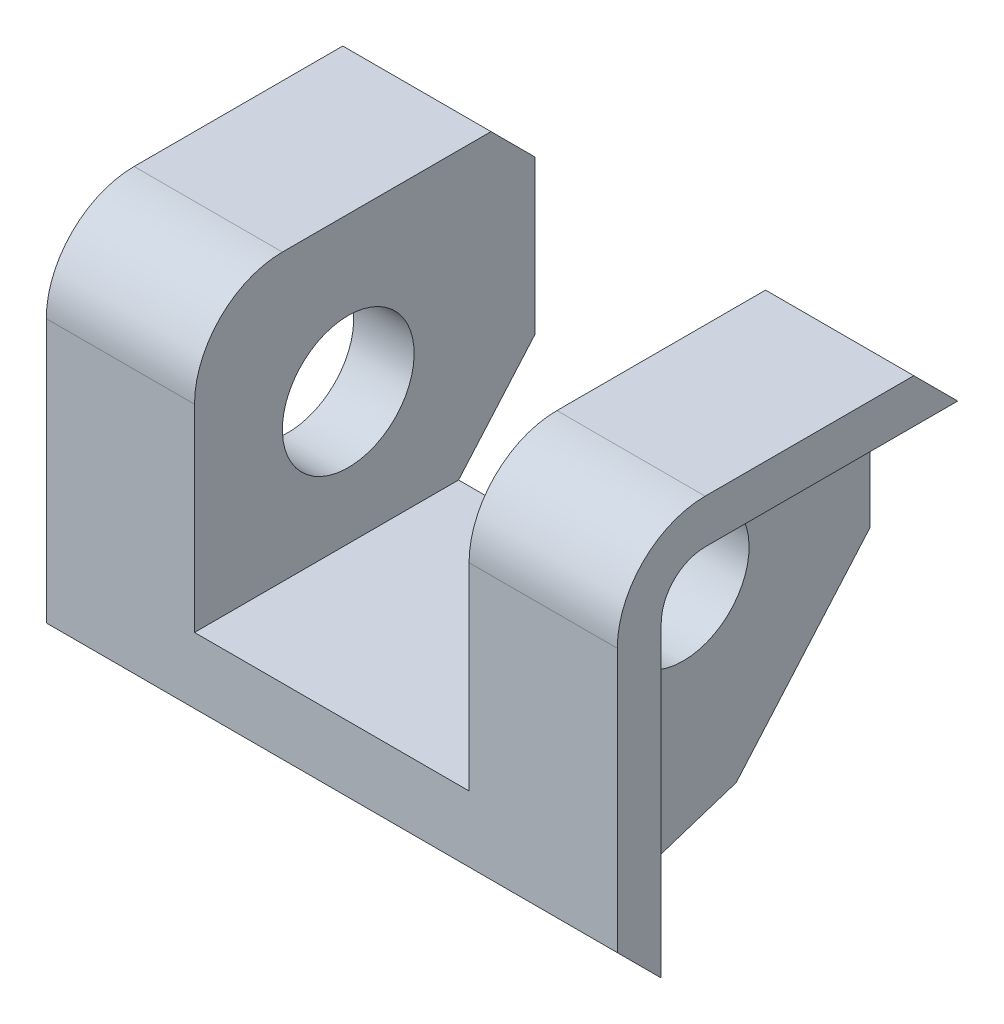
ISO-10303-21;
HEADER;
FILE_DESCRIPTION(('STEP AP214'),'2;1');
FILE_NAME('part.step','',(''),(''),'','','');
FILE_SCHEMA(('AUTOMOTIVE_DESIGN { 1 0 10303 214 1 1 1 1 }'));
ENDSEC;
DATA;
#1=APPLICATION_CONTEXT('core data for automotive mechanical design processes');
#2=APPLICATION_PROTOCOL_DEFINITION('international standard','automotive_design',2000,#1);
#3=PRODUCT_CONTEXT('',#1,'mechanical');
#4=PRODUCT('Part','Part','',(#3));
#5=PRODUCT_RELATED_PRODUCT_CATEGORY('part','',(#4));
#6=PRODUCT_DEFINITION_FORMATION('','',#4);
#7=PRODUCT_DEFINITION_CONTEXT('part definition',#1,'design');
#8=PRODUCT_DEFINITION('design','',#6,#7);
#9=PRODUCT_DEFINITION_SHAPE('','',#8);
#10=(LENGTH_UNIT() NAMED_UNIT(*) SI_UNIT(.MILLI.,.METRE.));
#11=(NAMED_UNIT(*) PLANE_ANGLE_UNIT() SI_UNIT($,.RADIAN.));
#12=(NAMED_UNIT(*) SI_UNIT($,.STERADIAN.) SOLID_ANGLE_UNIT());
#13=UNCERTAINTY_MEASURE_WITH_UNIT(LENGTH_MEASURE(1.E-05),#10,'distance_accuracy_value','');
#14=(GEOMETRIC_REPRESENTATION_CONTEXT(3) GLOBAL_UNCERTAINTY_ASSIGNED_CONTEXT((#13)) GLOBAL_UNIT_ASSIGNED_CONTEXT((#10,
#11,#12)) REPRESENTATION_CONTEXT('',''));
#15=CARTESIAN_POINT('',(0.,0.,0.));
#16=DIRECTION('',(0.,0.,1.));
#17=DIRECTION('',(1.,0.,0.));
#18=AXIS2_PLACEMENT_3D('',#15,#16,#17);
#19=CARTESIAN_POINT('',(-13.,-2.,-8.5));
#20=DIRECTION('',(0.,0.,-1.));
#21=DIRECTION('',(-1.,0.,0.));
#22=AXIS2_PLACEMENT_3D('',#19,#20,#21);
#23=PLANE('',#22);
#24=DIRECTION('',(0.,1.,0.));
#25=VECTOR('',#24,1.);
#26=CARTESIAN_POINT('',(6.25,-6.,-8.5));
#27=LINE('',#26,#25);
#28=CARTESIAN_POINT('',(6.25,-2.,-8.5));
#29=VERTEX_POINT('',#28);
#30=CARTESIAN_POINT('',(6.25,5.,-8.5));
#31=VERTEX_POINT('',#30);
#32=EDGE_CURVE('E199',#29,#31,#27,.T.);
#33=ORIENTED_EDGE('',*,*,#32,.T.);
#34=DIRECTION('',(1.,0.,0.));
#35=VECTOR('',#34,1.);
#36=CARTESIAN_POINT('',(-13.,5.,-8.5));
#37=LINE('',#36,#35);
#38=CARTESIAN_POINT('',(9.,5.,-8.5));
#39=VERTEX_POINT('',#38);
#40=EDGE_CURVE('E37',#31,#39,#37,.T.);
#41=ORIENTED_EDGE('',*,*,#40,.T.);
#42=DIRECTION('',(0.,1.,0.));
#43=VECTOR('',#42,1.);
#44=CARTESIAN_POINT('',(9.,-2.,-8.5));
#45=LINE('',#44,#43);
#46=CARTESIAN_POINT('',(9.,-2.,-8.5));
#47=VERTEX_POINT('',#46);
#48=EDGE_CURVE('E241',#47,#39,#45,.T.);
#49=ORIENTED_EDGE('',*,*,#48,.F.);
#50=DIRECTION('',(1.,0.,0.));
#51=VECTOR('',#50,1.);
#52=CARTESIAN_POINT('',(-13.,-2.,-8.5));
#53=LINE('',#52,#51);
#54=EDGE_CURVE('E329',#29,#47,#53,.T.);
#55=ORIENTED_EDGE('',*,*,#54,.F.);
#56=EDGE_LOOP('',(#33,#41,#49,#55));
#57=FACE_BOUND('',#56,.T.);
#58=ADVANCED_FACE('F14',(#57),#23,.T.);
#59=CARTESIAN_POINT('',(-13.,0.,0.));
#60=DIRECTION('',(1.,0.,0.));
#61=DIRECTION('',(0.,-1.,0.));
#62=AXIS2_PLACEMENT_3D('',#59,#60,#61);
#63=CYLINDRICAL_SURFACE('',#62,3.);
#64=CARTESIAN_POINT('',(6.25,0.,0.));
#65=DIRECTION('',(1.,0.,0.));
#66=DIRECTION('',(0.,-1.,0.));
#67=AXIS2_PLACEMENT_3D('',#64,#65,#66);
#68=CIRCLE('',#67,3.);
#69=CARTESIAN_POINT('',(6.25,-3.,0.));
#70=VERTEX_POINT('',#69);
#71=EDGE_CURVE('E215',#70,#70,#68,.T.);
#72=ORIENTED_EDGE('',*,*,#71,.F.);
#73=EDGE_LOOP('',(#72));
#74=FACE_BOUND('',#73,.T.);
#75=CARTESIAN_POINT('',(9.,0.,0.));
#76=DIRECTION('',(1.,0.,0.));
#77=DIRECTION('',(0.,-1.,0.));
#78=AXIS2_PLACEMENT_3D('',#75,#76,#77);
#79=CIRCLE('',#78,3.);
#80=CARTESIAN_POINT('',(9.,-3.,0.));
#81=VERTEX_POINT('',#80);
#82=EDGE_CURVE('E250',#81,#81,#79,.T.);
#83=ORIENTED_EDGE('',*,*,#82,.T.);
#84=EDGE_LOOP('',(#83));
#85=FACE_BOUND('',#84,.T.);
#86=ADVANCED_FACE('F455',(#74,#85),#63,.F.);
#87=CARTESIAN_POINT('',(-13.,3.,3.));
#88=DIRECTION('',(1.,0.,0.));
#89=DIRECTION('',(0.,-1.,0.));
#90=AXIS2_PLACEMENT_3D('',#87,#88,#89);
#91=CYLINDRICAL_SURFACE('',#90,4.);
#92=CARTESIAN_POINT('',(6.25,3.,3.));
#93=DIRECTION('',(1.,0.,0.));
#94=DIRECTION('',(0.,-1.,0.));
#95=AXIS2_PLACEMENT_3D('',#92,#93,#94);
#96=CIRCLE('',#95,4.);
#97=CARTESIAN_POINT('',(6.25,3.,7.));
#98=VERTEX_POINT('',#97);
#99=CARTESIAN_POINT('',(6.25,7.,3.));
#100=VERTEX_POINT('',#99);
#101=EDGE_CURVE('E213',#98,#100,#96,.F.);
#102=ORIENTED_EDGE('',*,*,#101,.F.);
#103=DIRECTION('',(1.,0.,0.));
#104=VECTOR('',#103,1.);
#105=CARTESIAN_POINT('',(-13.,3.,7.));
#106=LINE('',#105,#104);
#107=CARTESIAN_POINT('',(13.,3.,7.));
#108=VERTEX_POINT('',#107);
#109=EDGE_CURVE('E195',#98,#108,#106,.T.);
#110=ORIENTED_EDGE('',*,*,#109,.T.);
#111=CARTESIAN_POINT('',(13.,3.,3.));
#112=DIRECTION('',(1.,0.,0.));
#113=DIRECTION('',(0.,-1.,0.));
#114=AXIS2_PLACEMENT_3D('',#111,#112,#113);
#115=CIRCLE('',#114,4.);
#116=CARTESIAN_POINT('',(13.,7.,3.));
#117=VERTEX_POINT('',#116);
#118=EDGE_CURVE('E292',#117,#108,#115,.T.);
#119=ORIENTED_EDGE('',*,*,#118,.F.);
#120=DIRECTION('',(1.,0.,0.));
#121=VECTOR('',#120,1.);
#122=CARTESIAN_POINT('',(-13.,7.,3.));
#123=LINE('',#122,#121);
#124=EDGE_CURVE('E308',#100,#117,#123,.T.);
#125=ORIENTED_EDGE('',*,*,#124,.F.);
#126=EDGE_LOOP('',(#102,#110,#119,#125));
#127=FACE_BOUND('',#126,.T.);
#128=ADVANCED_FACE('F408',(#127),#91,.T.);
#129=CARTESIAN_POINT('',(-13.,7.,-8.5));
#130=DIRECTION('',(0.,1.,0.));
#131=DIRECTION('',(0.,0.,-1.));
#132=AXIS2_PLACEMENT_3D('',#129,#130,#131);
#133=PLANE('',#132);
#134=DIRECTION('',(0.,0.,-1.));
#135=VECTOR('',#134,1.);
#136=CARTESIAN_POINT('',(6.25,7.,-8.5));
#137=LINE('',#136,#135);
#138=CARTESIAN_POINT('',(6.25,7.,-6.5));
#139=VERTEX_POINT('',#138);
#140=EDGE_CURVE('E211',#100,#139,#137,.T.);
#141=ORIENTED_EDGE('',*,*,#140,.F.);
#142=ORIENTED_EDGE('',*,*,#124,.T.);
#143=DIRECTION('',(0.,0.,1.));
#144=VECTOR('',#143,1.);
#145=CARTESIAN_POINT('',(13.,7.,-8.5));
#146=LINE('',#145,#144);
#147=CARTESIAN_POINT('',(13.,7.,-6.5));
#148=VERTEX_POINT('',#147);
#149=EDGE_CURVE('E289',#148,#117,#146,.T.);
#150=ORIENTED_EDGE('',*,*,#149,.F.);
#151=DIRECTION('',(-1.,0.,0.));
#152=VECTOR('',#151,1.);
#153=CARTESIAN_POINT('',(-13.,7.,-6.5));
#154=LINE('',#153,#152);
#155=EDGE_CURVE('E350',#148,#139,#154,.T.);
#156=ORIENTED_EDGE('',*,*,#155,.T.);
#157=EDGE_LOOP('',(#141,#142,#150,#156));
#158=FACE_BOUND('',#157,.T.);
#159=ADVANCED_FACE('F404',(#158),#133,.T.);
#160=CARTESIAN_POINT('',(-13.,5.,-8.5));
#161=DIRECTION('',(0.,-0.707106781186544,0.707106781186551));
#162=DIRECTION('',(0.,0.707106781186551,0.707106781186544));
#163=AXIS2_PLACEMENT_3D('',#160,#161,#162);
#164=PLANE('',#163);
#165=DIRECTION('',(0.,0.707106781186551,0.707106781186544));
#166=VECTOR('',#165,1.);
#167=CARTESIAN_POINT('',(6.25,5.,-8.5));
#168=LINE('',#167,#166);
#169=EDGE_CURVE('E9',#139,#31,#168,.F.);
#170=ORIENTED_EDGE('',*,*,#169,.F.);
#171=ORIENTED_EDGE('',*,*,#155,.F.);
#172=DIRECTION('',(0.,-0.707106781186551,-0.707106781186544));
#173=VECTOR('',#172,1.);
#174=CARTESIAN_POINT('',(13.,9.75,-3.75000000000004));
#175=LINE('',#174,#173);
#176=CARTESIAN_POINT('',(13.,5.,-8.5));
#177=VERTEX_POINT('',#176);
#178=EDGE_CURVE('E336',#177,#148,#175,.F.);
#179=ORIENTED_EDGE('',*,*,#178,.F.);
#180=DIRECTION('',(1.,0.,0.));
#181=VECTOR('',#180,1.);
#182=CARTESIAN_POINT('',(9.,5.,-8.5));
#183=LINE('',#182,#181);
#184=EDGE_CURVE('E243',#39,#177,#183,.T.);
#185=ORIENTED_EDGE('',*,*,#184,.F.);
#186=ORIENTED_EDGE('',*,*,#40,.F.);
#187=EDGE_LOOP('',(#170,#171,#179,#185,#186));
#188=FACE_BOUND('',#187,.T.);
#189=ADVANCED_FACE('F401',(#188),#164,.F.);
#190=DIRECTION('',(0.,-1.,0.));
#191=VECTOR('',#190,1.);
#192=CARTESIAN_POINT('',(-6.25,20.,-8.5));
#193=LINE('',#192,#191);
#194=CARTESIAN_POINT('',(-6.25,5.,-8.5));
#195=VERTEX_POINT('',#194);
#196=CARTESIAN_POINT('',(-6.25,-2.,-8.5));
#197=VERTEX_POINT('',#196);
#198=EDGE_CURVE('E29',#195,#197,#193,.T.);
#199=ORIENTED_EDGE('',*,*,#198,.T.);
#200=CARTESIAN_POINT('',(-9.,-2.,-8.5));
#201=VERTEX_POINT('',#200);
#202=EDGE_CURVE('E330',#201,#197,#53,.T.);
#203=ORIENTED_EDGE('',*,*,#202,.F.);
#204=DIRECTION('',(0.,1.,0.));
#205=VECTOR('',#204,1.);
#206=CARTESIAN_POINT('',(-9.,-2.,-8.5));
#207=LINE('',#206,#205);
#208=CARTESIAN_POINT('',(-9.,5.,-8.5));
#209=VERTEX_POINT('',#208);
#210=EDGE_CURVE('E266',#201,#209,#207,.T.);
#211=ORIENTED_EDGE('',*,*,#210,.T.);
#212=EDGE_CURVE('E349',#209,#195,#37,.T.);
#213=ORIENTED_EDGE('',*,*,#212,.T.);
#214=EDGE_LOOP('',(#199,#203,#211,#213));
#215=FACE_BOUND('',#214,.T.);
#216=ADVANCED_FACE('F411',(#215),#23,.T.);
#217=CARTESIAN_POINT('',(-13.,-9.,-2.41499283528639));
#218=DIRECTION('',(0.,-0.656059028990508,-0.754709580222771));
#219=DIRECTION('',(0.,-0.754709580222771,0.656059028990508));
#220=AXIS2_PLACEMENT_3D('',#217,#218,#219);
#221=PLANE('',#220);
#222=DIRECTION('',(0.,-0.754709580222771,0.656059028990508));
#223=VECTOR('',#222,1.);
#224=CARTESIAN_POINT('',(6.25,-9.,-2.41499283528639));
#225=LINE('',#224,#223);
#226=CARTESIAN_POINT('',(6.25,-6.,-5.02285304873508));
#227=VERTEX_POINT('',#226);
#228=EDGE_CURVE('E177',#29,#227,#225,.T.);
#229=ORIENTED_EDGE('',*,*,#228,.F.);
#230=ORIENTED_EDGE('',*,*,#54,.T.);
#231=DIRECTION('',(0.,0.754709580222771,-0.656059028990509));
#232=VECTOR('',#231,1.);
#233=CARTESIAN_POINT('',(9.,-9.,-2.41499283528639));
#234=LINE('',#233,#232);
#235=CARTESIAN_POINT('',(9.,-9.,-2.41499283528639));
#236=VERTEX_POINT('',#235);
#237=EDGE_CURVE('E227',#236,#47,#234,.T.);
#238=ORIENTED_EDGE('',*,*,#237,.F.);
#239=DIRECTION('',(1.,0.,0.));
#240=VECTOR('',#239,1.);
#241=CARTESIAN_POINT('',(-13.,-9.,-2.41499283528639));
#242=LINE('',#241,#240);
#243=CARTESIAN_POINT('',(-9.,-9.,-2.41499283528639));
#244=VERTEX_POINT('',#243);
#245=EDGE_CURVE('E326',#244,#236,#242,.T.);
#246=ORIENTED_EDGE('',*,*,#245,.F.);
#247=DIRECTION('',(0.,0.754709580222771,-0.656059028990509));
#248=VECTOR('',#247,1.);
#249=CARTESIAN_POINT('',(-9.,-9.,-2.41499283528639));
#250=LINE('',#249,#248);
#251=EDGE_CURVE('E263',#244,#201,#250,.T.);
#252=ORIENTED_EDGE('',*,*,#251,.T.);
#253=ORIENTED_EDGE('',*,*,#202,.T.);
#254=DIRECTION('',(0.,0.754709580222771,-0.656059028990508));
#255=VECTOR('',#254,1.);
#256=CARTESIAN_POINT('',(-6.25,-9.,-2.41499283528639));
#257=LINE('',#256,#255);
#258=CARTESIAN_POINT('',(-6.25,-6.,-5.02285304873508));
#259=VERTEX_POINT('',#258);
#260=EDGE_CURVE('E209',#259,#197,#257,.T.);
#261=ORIENTED_EDGE('',*,*,#260,.F.);
#262=DIRECTION('',(1.,0.,0.));
#263=VECTOR('',#262,1.);
#264=CARTESIAN_POINT('',(-13.,-6.,-5.02285304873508));
#265=LINE('',#264,#263);
#266=EDGE_CURVE('E219',#259,#227,#265,.T.);
#267=ORIENTED_EDGE('',*,*,#266,.T.);
#268=EDGE_LOOP('',(#229,#230,#238,#246,#252,#253,#261,#267));
#269=FACE_BOUND('',#268,.T.);
#270=ADVANCED_FACE('F16',(#269),#221,.T.);
#271=CARTESIAN_POINT('',(-13.,-9.,-2.41499283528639));
#272=DIRECTION('',(0.,0.951056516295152,0.309016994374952));
#273=DIRECTION('',(0.,0.309016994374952,-0.951056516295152));
#274=AXIS2_PLACEMENT_3D('',#271,#272,#273);
#275=PLANE('',#274);
#276=DIRECTION('',(0.,-0.309016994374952,0.951056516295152));
#277=VECTOR('',#276,1.);
#278=CARTESIAN_POINT('',(9.,-9.,-2.41499283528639));
#279=LINE('',#278,#277);
#280=CARTESIAN_POINT('',(9.,-10.7594378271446,3.));
#281=VERTEX_POINT('',#280);
#282=EDGE_CURVE('E230',#236,#281,#279,.T.);
#283=ORIENTED_EDGE('',*,*,#282,.T.);
#284=DIRECTION('',(1.,0.,0.));
#285=VECTOR('',#284,1.);
#286=CARTESIAN_POINT('',(-13.,-10.7594378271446,3.));
#287=LINE('',#286,#285);
#288=CARTESIAN_POINT('',(-9.,-10.7594378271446,3.));
#289=VERTEX_POINT('',#288);
#290=EDGE_CURVE('E323',#289,#281,#287,.T.);
#291=ORIENTED_EDGE('',*,*,#290,.F.);
#292=DIRECTION('',(0.,-0.309016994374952,0.951056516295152));
#293=VECTOR('',#292,1.);
#294=CARTESIAN_POINT('',(-9.,-9.,-2.41499283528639));
#295=LINE('',#294,#293);
#296=EDGE_CURVE('E277',#244,#289,#295,.T.);
#297=ORIENTED_EDGE('',*,*,#296,.F.);
#298=ORIENTED_EDGE('',*,*,#245,.T.);
#299=EDGE_LOOP('',(#283,#291,#297,#298));
#300=FACE_BOUND('',#299,.T.);
#301=ADVANCED_FACE('F422',(#300),#275,.F.);
#302=CARTESIAN_POINT('',(-13.,-10.7594378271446,3.));
#303=DIRECTION('',(0.,0.,-1.));
#304=DIRECTION('',(-1.,0.,0.));
#305=AXIS2_PLACEMENT_3D('',#302,#303,#304);
#306=PLANE('',#305);
#307=DIRECTION('',(0.,-1.,0.));
#308=VECTOR('',#307,1.);
#309=CARTESIAN_POINT('',(9.,-10.7594378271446,3.));
#310=LINE('',#309,#308);
#311=CARTESIAN_POINT('',(9.,-7.5,3.));
#312=VERTEX_POINT('',#311);
#313=EDGE_CURVE('E255',#312,#281,#310,.T.);
#314=ORIENTED_EDGE('',*,*,#313,.F.);
#315=DIRECTION('',(1.,0.,0.));
#316=VECTOR('',#315,1.);
#317=CARTESIAN_POINT('',(-13.,-7.5,3.));
#318=LINE('',#317,#316);
#319=CARTESIAN_POINT('',(-9.,-7.5,3.));
#320=VERTEX_POINT('',#319);
#321=EDGE_CURVE('E320',#320,#312,#318,.T.);
#322=ORIENTED_EDGE('',*,*,#321,.F.);
#323=DIRECTION('',(0.,1.,0.));
#324=VECTOR('',#323,1.);
#325=CARTESIAN_POINT('',(-9.,-10.7594378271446,3.));
#326=LINE('',#325,#324);
#327=EDGE_CURVE('E287',#289,#320,#326,.T.);
#328=ORIENTED_EDGE('',*,*,#327,.F.);
#329=ORIENTED_EDGE('',*,*,#290,.T.);
#330=EDGE_LOOP('',(#314,#322,#328,#329));
#331=FACE_BOUND('',#330,.T.);
#332=ADVANCED_FACE('F429',(#331),#306,.F.);
#333=CARTESIAN_POINT('',(-13.,-7.5,3.));
#334=DIRECTION('',(0.,1.,0.));
#335=DIRECTION('',(1.,0.,0.));
#336=AXIS2_PLACEMENT_3D('',#333,#334,#335);
#337=PLANE('',#336);
#338=DIRECTION('',(0.,0.,-1.));
#339=VECTOR('',#338,1.);
#340=CARTESIAN_POINT('',(9.,-7.5,3.));
#341=LINE('',#340,#339);
#342=CARTESIAN_POINT('',(9.,-7.5,5.));
#343=VERTEX_POINT('',#342);
#344=EDGE_CURVE('E253',#343,#312,#341,.T.);
#345=ORIENTED_EDGE('',*,*,#344,.F.);
#346=DIRECTION('',(1.,0.,0.));
#347=VECTOR('',#346,1.);
#348=CARTESIAN_POINT('',(-13.,-7.5,5.));
#349=LINE('',#348,#347);
#350=CARTESIAN_POINT('',(-9.,-7.5,5.));
#351=VERTEX_POINT('',#350);
#352=EDGE_CURVE('E317',#351,#343,#349,.T.);
#353=ORIENTED_EDGE('',*,*,#352,.F.);
#354=DIRECTION('',(0.,0.,1.));
#355=VECTOR('',#354,1.);
#356=CARTESIAN_POINT('',(-9.,-7.5,3.));
#357=LINE('',#356,#355);
#358=EDGE_CURVE('E285',#320,#351,#357,.T.);
#359=ORIENTED_EDGE('',*,*,#358,.F.);
#360=ORIENTED_EDGE('',*,*,#321,.T.);
#361=EDGE_LOOP('',(#345,#353,#359,#360));
#362=FACE_BOUND('',#361,.T.);
#363=ADVANCED_FACE('F432',(#362),#337,.F.);
#364=CARTESIAN_POINT('',(-6.25,0.,0.));
#365=DIRECTION('',(-1.,0.,0.));
#366=DIRECTION('',(0.,1.,0.));
#367=AXIS2_PLACEMENT_3D('',#364,#365,#366);
#368=CIRCLE('',#367,3.);
#369=CARTESIAN_POINT('',(-6.25,3.,0.));
#370=VERTEX_POINT('',#369);
#371=EDGE_CURVE('E206',#370,#370,#368,.T.);
#372=ORIENTED_EDGE('',*,*,#371,.F.);
#373=EDGE_LOOP('',(#372));
#374=FACE_BOUND('',#373,.T.);
#375=CARTESIAN_POINT('',(-9.,0.,0.));
#376=DIRECTION('',(-1.,0.,0.));
#377=DIRECTION('',(0.,1.,0.));
#378=AXIS2_PLACEMENT_3D('',#375,#376,#377);
#379=CIRCLE('',#378,3.);
#380=CARTESIAN_POINT('',(-9.,3.,0.));
#381=VERTEX_POINT('',#380);
#382=EDGE_CURVE('E284',#381,#381,#379,.T.);
#383=ORIENTED_EDGE('',*,*,#382,.T.);
#384=EDGE_LOOP('',(#383));
#385=FACE_BOUND('',#384,.T.);
#386=ADVANCED_FACE('F463',(#374,#385),#63,.F.);
#387=CARTESIAN_POINT('',(13.,3.,3.));
#388=DIRECTION('',(1.,0.,0.));
#389=DIRECTION('',(0.,-1.,0.));
#390=AXIS2_PLACEMENT_3D('',#387,#388,#389);
#391=PLANE('',#390);
#392=DIRECTION('',(0.,1.,0.));
#393=VECTOR('',#392,1.);
#394=CARTESIAN_POINT('',(13.,-11.,5.));
#395=LINE('',#394,#393);
#396=CARTESIAN_POINT('',(13.,-11.,5.));
#397=VERTEX_POINT('',#396);
#398=CARTESIAN_POINT('',(13.,3.,5.));
#399=VERTEX_POINT('',#398);
#400=EDGE_CURVE('E297',#397,#399,#395,.T.);
#401=ORIENTED_EDGE('',*,*,#400,.T.);
#402=CARTESIAN_POINT('',(13.,3.,3.));
#403=DIRECTION('',(-1.,0.,0.));
#404=DIRECTION('',(0.,1.,0.));
#405=AXIS2_PLACEMENT_3D('',#402,#403,#404);
#406=CIRCLE('',#405,2.);
#407=CARTESIAN_POINT('',(13.,5.,3.));
#408=VERTEX_POINT('',#407);
#409=EDGE_CURVE('E221',#399,#408,#406,.T.);
#410=ORIENTED_EDGE('',*,*,#409,.T.);
#411=DIRECTION('',(0.,0.,1.));
#412=VECTOR('',#411,1.);
#413=CARTESIAN_POINT('',(13.,5.,-8.5));
#414=LINE('',#413,#412);
#415=EDGE_CURVE('E224',#177,#408,#414,.T.);
#416=ORIENTED_EDGE('',*,*,#415,.F.);
#417=ORIENTED_EDGE('',*,*,#178,.T.);
#418=ORIENTED_EDGE('',*,*,#149,.T.);
#419=ORIENTED_EDGE('',*,*,#118,.T.);
#420=DIRECTION('',(0.,1.,0.));
#421=VECTOR('',#420,1.);
#422=CARTESIAN_POINT('',(13.,-11.,7.));
#423=LINE('',#422,#421);
#424=CARTESIAN_POINT('',(13.,-9.,7.));
#425=VERTEX_POINT('',#424);
#426=EDGE_CURVE('E295',#425,#108,#423,.T.);
#427=ORIENTED_EDGE('',*,*,#426,.F.);
#428=DIRECTION('',(0.,0.707106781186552,0.707106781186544));
#429=VECTOR('',#428,1.);
#430=CARTESIAN_POINT('',(13.,-4.99999999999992,11.));
#431=LINE('',#430,#429);
#432=EDGE_CURVE('E338',#425,#397,#431,.F.);
#433=ORIENTED_EDGE('',*,*,#432,.T.);
#434=EDGE_LOOP('',(#401,#410,#416,#417,#418,#419,#427,#433));
#435=FACE_BOUND('',#434,.T.);
#436=ADVANCED_FACE('F384',(#435),#391,.T.);
#437=CARTESIAN_POINT('',(-13.,3.,3.));
#438=DIRECTION('',(1.,0.,0.));
#439=DIRECTION('',(0.,-1.,0.));
#440=AXIS2_PLACEMENT_3D('',#437,#438,#439);
#441=PLANE('',#440);
#442=DIRECTION('',(0.,0.,1.));
#443=VECTOR('',#442,1.);
#444=CARTESIAN_POINT('',(-13.,5.,-8.5));
#445=LINE('',#444,#443);
#446=CARTESIAN_POINT('',(-13.,5.,-8.5));
#447=VERTEX_POINT('',#446);
#448=CARTESIAN_POINT('',(-13.,5.,3.));
#449=VERTEX_POINT('',#448);
#450=EDGE_CURVE('E257',#447,#449,#445,.T.);
#451=ORIENTED_EDGE('',*,*,#450,.T.);
#452=CARTESIAN_POINT('',(-13.,3.,3.));
#453=DIRECTION('',(-1.,0.,0.));
#454=DIRECTION('',(0.,1.,0.));
#455=AXIS2_PLACEMENT_3D('',#452,#453,#454);
#456=CIRCLE('',#455,2.);
#457=CARTESIAN_POINT('',(-13.,3.,5.));
#458=VERTEX_POINT('',#457);
#459=EDGE_CURVE('E260',#458,#449,#456,.T.);
#460=ORIENTED_EDGE('',*,*,#459,.F.);
#461=DIRECTION('',(0.,1.,0.));
#462=VECTOR('',#461,1.);
#463=CARTESIAN_POINT('',(-13.,-11.,5.));
#464=LINE('',#463,#462);
#465=CARTESIAN_POINT('',(-13.,-11.,5.));
#466=VERTEX_POINT('',#465);
#467=EDGE_CURVE('E306',#466,#458,#464,.T.);
#468=ORIENTED_EDGE('',*,*,#467,.F.);
#469=DIRECTION('',(0.,-0.707106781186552,-0.707106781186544));
#470=VECTOR('',#469,1.);
#471=CARTESIAN_POINT('',(-13.,-9.,7.));
#472=LINE('',#471,#470);
#473=CARTESIAN_POINT('',(-13.,-9.,7.));
#474=VERTEX_POINT('',#473);
#475=EDGE_CURVE('E344',#466,#474,#472,.F.);
#476=ORIENTED_EDGE('',*,*,#475,.T.);
#477=DIRECTION('',(0.,1.,0.));
#478=VECTOR('',#477,1.);
#479=CARTESIAN_POINT('',(-13.,-11.,7.));
#480=LINE('',#479,#478);
#481=CARTESIAN_POINT('',(-13.,3.,7.));
#482=VERTEX_POINT('',#481);
#483=EDGE_CURVE('E304',#474,#482,#480,.T.);
#484=ORIENTED_EDGE('',*,*,#483,.T.);
#485=CARTESIAN_POINT('',(-13.,3.,3.));
#486=DIRECTION('',(1.,0.,0.));
#487=DIRECTION('',(0.,-1.,0.));
#488=AXIS2_PLACEMENT_3D('',#485,#486,#487);
#489=CIRCLE('',#488,4.);
#490=CARTESIAN_POINT('',(-13.,7.,3.));
#491=VERTEX_POINT('',#490);
#492=EDGE_CURVE('E301',#491,#482,#489,.T.);
#493=ORIENTED_EDGE('',*,*,#492,.F.);
#494=DIRECTION('',(0.,0.,1.));
#495=VECTOR('',#494,1.);
#496=CARTESIAN_POINT('',(-13.,7.,-8.5));
#497=LINE('',#496,#495);
#498=CARTESIAN_POINT('',(-13.,7.,-6.5));
#499=VERTEX_POINT('',#498);
#500=EDGE_CURVE('E299',#499,#491,#497,.T.);
#501=ORIENTED_EDGE('',*,*,#500,.F.);
#502=DIRECTION('',(0.,0.707106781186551,0.707106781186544));
#503=VECTOR('',#502,1.);
#504=CARTESIAN_POINT('',(-13.,5.,-8.5));
#505=LINE('',#504,#503);
#506=EDGE_CURVE('E341',#499,#447,#505,.F.);
#507=ORIENTED_EDGE('',*,*,#506,.T.);
#508=EDGE_LOOP('',(#451,#460,#468,#476,#484,#493,#501,#507));
#509=FACE_BOUND('',#508,.T.);
#510=ADVANCED_FACE('F370',(#509),#441,.F.);
#511=CARTESIAN_POINT('',(-13.,-11.,5.));
#512=DIRECTION('',(0.,0.,-1.));
#513=DIRECTION('',(-1.,0.,0.));
#514=AXIS2_PLACEMENT_3D('',#511,#512,#513);
#515=PLANE('',#514);
#516=ORIENTED_EDGE('',*,*,#400,.F.);
#517=DIRECTION('',(1.,0.,0.));
#518=VECTOR('',#517,1.);
#519=CARTESIAN_POINT('',(-13.,-11.,5.));
#520=LINE('',#519,#518);
#521=EDGE_CURVE('E315',#466,#397,#520,.T.);
#522=ORIENTED_EDGE('',*,*,#521,.F.);
#523=ORIENTED_EDGE('',*,*,#467,.T.);
#524=DIRECTION('',(-1.,0.,0.));
#525=VECTOR('',#524,1.);
#526=CARTESIAN_POINT('',(-9.,3.,5.));
#527=LINE('',#526,#525);
#528=CARTESIAN_POINT('',(-9.,3.,5.));
#529=VERTEX_POINT('',#528);
#530=EDGE_CURVE('E279',#529,#458,#527,.T.);
#531=ORIENTED_EDGE('',*,*,#530,.F.);
#532=DIRECTION('',(0.,1.,0.));
#533=VECTOR('',#532,1.);
#534=CARTESIAN_POINT('',(-9.,-11.4092772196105,5.));
#535=LINE('',#534,#533);
#536=EDGE_CURVE('E275',#351,#529,#535,.T.);
#537=ORIENTED_EDGE('',*,*,#536,.F.);
#538=ORIENTED_EDGE('',*,*,#352,.T.);
#539=DIRECTION('',(0.,1.,0.));
#540=VECTOR('',#539,1.);
#541=CARTESIAN_POINT('',(9.,-11.4092772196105,5.));
#542=LINE('',#541,#540);
#543=CARTESIAN_POINT('',(9.,3.,5.));
#544=VERTEX_POINT('',#543);
#545=EDGE_CURVE('E233',#343,#544,#542,.T.);
#546=ORIENTED_EDGE('',*,*,#545,.T.);
#547=DIRECTION('',(1.,0.,0.));
#548=VECTOR('',#547,1.);
#549=CARTESIAN_POINT('',(9.,3.,5.));
#550=LINE('',#549,#548);
#551=EDGE_CURVE('E247',#544,#399,#550,.T.);
#552=ORIENTED_EDGE('',*,*,#551,.T.);
#553=EDGE_LOOP('',(#516,#522,#523,#531,#537,#538,#546,#552));
#554=FACE_BOUND('',#553,.T.);
#555=ADVANCED_FACE('F386',(#554),#515,.T.);
#556=CARTESIAN_POINT('',(-13.,-11.,7.));
#557=DIRECTION('',(0.,0.,-1.));
#558=DIRECTION('',(0.,-1.,0.));
#559=AXIS2_PLACEMENT_3D('',#556,#557,#558);
#560=PLANE('',#559);
#561=ORIENTED_EDGE('',*,*,#109,.F.);
#562=DIRECTION('',(0.,1.,0.));
#563=VECTOR('',#562,1.);
#564=CARTESIAN_POINT('',(6.25,-6.,7.));
#565=LINE('',#564,#563);
#566=CARTESIAN_POINT('',(6.25,-6.,7.));
#567=VERTEX_POINT('',#566);
#568=EDGE_CURVE('E174',#567,#98,#565,.T.);
#569=ORIENTED_EDGE('',*,*,#568,.F.);
#570=DIRECTION('',(-1.,0.,0.));
#571=VECTOR('',#570,1.);
#572=CARTESIAN_POINT('',(6.25,-6.,7.));
#573=LINE('',#572,#571);
#574=CARTESIAN_POINT('',(-6.25,-6.,7.));
#575=VERTEX_POINT('',#574);
#576=EDGE_CURVE('E185',#567,#575,#573,.T.);
#577=ORIENTED_EDGE('',*,*,#576,.T.);
#578=DIRECTION('',(0.,-1.,0.));
#579=VECTOR('',#578,1.);
#580=CARTESIAN_POINT('',(-6.25,20.,7.));
#581=LINE('',#580,#579);
#582=CARTESIAN_POINT('',(-6.25,3.,7.));
#583=VERTEX_POINT('',#582);
#584=EDGE_CURVE('E190',#583,#575,#581,.T.);
#585=ORIENTED_EDGE('',*,*,#584,.F.);
#586=EDGE_CURVE('E312',#482,#583,#106,.T.);
#587=ORIENTED_EDGE('',*,*,#586,.F.);
#588=ORIENTED_EDGE('',*,*,#483,.F.);
#589=DIRECTION('',(1.,0.,0.));
#590=VECTOR('',#589,1.);
#591=CARTESIAN_POINT('',(-13.,-9.,7.));
#592=LINE('',#591,#590);
#593=EDGE_CURVE('E333',#474,#425,#592,.T.);
#594=ORIENTED_EDGE('',*,*,#593,.T.);
#595=ORIENTED_EDGE('',*,*,#426,.T.);
#596=EDGE_LOOP('',(#561,#569,#577,#585,#587,#588,#594,#595));
#597=FACE_BOUND('',#596,.T.);
#598=ADVANCED_FACE('F193',(#597),#560,.F.);
#599=CARTESIAN_POINT('',(-6.25,3.,3.));
#600=DIRECTION('',(-1.,0.,0.));
#601=DIRECTION('',(0.,1.,0.));
#602=AXIS2_PLACEMENT_3D('',#599,#600,#601);
#603=CIRCLE('',#602,4.);
#604=CARTESIAN_POINT('',(-6.25,7.,3.));
#605=VERTEX_POINT('',#604);
#606=EDGE_CURVE('E204',#605,#583,#603,.F.);
#607=ORIENTED_EDGE('',*,*,#606,.F.);
#608=EDGE_CURVE('E309',#491,#605,#123,.T.);
#609=ORIENTED_EDGE('',*,*,#608,.F.);
#610=ORIENTED_EDGE('',*,*,#492,.T.);
#611=ORIENTED_EDGE('',*,*,#586,.T.);
#612=EDGE_LOOP('',(#607,#609,#610,#611));
#613=FACE_BOUND('',#612,.T.);
#614=ADVANCED_FACE('F374',(#613),#91,.T.);
#615=DIRECTION('',(0.,0.,1.));
#616=VECTOR('',#615,1.);
#617=CARTESIAN_POINT('',(-6.25,7.,-8.5));
#618=LINE('',#617,#616);
#619=CARTESIAN_POINT('',(-6.25,7.,-6.5));
#620=VERTEX_POINT('',#619);
#621=EDGE_CURVE('E180',#620,#605,#618,.T.);
#622=ORIENTED_EDGE('',*,*,#621,.F.);
#623=EDGE_CURVE('E348',#620,#499,#154,.T.);
#624=ORIENTED_EDGE('',*,*,#623,.T.);
#625=ORIENTED_EDGE('',*,*,#500,.T.);
#626=ORIENTED_EDGE('',*,*,#608,.T.);
#627=EDGE_LOOP('',(#622,#624,#625,#626));
#628=FACE_BOUND('',#627,.T.);
#629=ADVANCED_FACE('F363',(#628),#133,.T.);
#630=CARTESIAN_POINT('',(-13.,-9.,7.));
#631=DIRECTION('',(0.,0.707106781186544,-0.707106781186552));
#632=DIRECTION('',(0.,-0.707106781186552,-0.707106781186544));
#633=AXIS2_PLACEMENT_3D('',#630,#631,#632);
#634=PLANE('',#633);
#635=ORIENTED_EDGE('',*,*,#475,.F.);
#636=ORIENTED_EDGE('',*,*,#521,.T.);
#637=ORIENTED_EDGE('',*,*,#432,.F.);
#638=ORIENTED_EDGE('',*,*,#593,.F.);
#639=EDGE_LOOP('',(#635,#636,#637,#638));
#640=FACE_BOUND('',#639,.T.);
#641=ADVANCED_FACE('F381',(#640),#634,.F.);
#642=DIRECTION('',(0.,-0.707106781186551,-0.707106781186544));
#643=VECTOR('',#642,1.);
#644=CARTESIAN_POINT('',(-6.25,5.,-8.5));
#645=LINE('',#644,#643);
#646=EDGE_CURVE('E22',#195,#620,#645,.F.);
#647=ORIENTED_EDGE('',*,*,#646,.F.);
#648=ORIENTED_EDGE('',*,*,#212,.F.);
#649=EDGE_CURVE('E346',#447,#209,#37,.T.);
#650=ORIENTED_EDGE('',*,*,#649,.F.);
#651=ORIENTED_EDGE('',*,*,#506,.F.);
#652=ORIENTED_EDGE('',*,*,#623,.F.);
#653=EDGE_LOOP('',(#647,#648,#650,#651,#652));
#654=FACE_BOUND('',#653,.T.);
#655=ADVANCED_FACE('F367',(#654),#164,.F.);
#656=CARTESIAN_POINT('',(-9.,3.,3.));
#657=DIRECTION('',(-1.,0.,0.));
#658=DIRECTION('',(0.,1.,0.));
#659=AXIS2_PLACEMENT_3D('',#656,#657,#658);
#660=PLANE('',#659);
#661=ORIENTED_EDGE('',*,*,#382,.F.);
#662=EDGE_LOOP('',(#661));
#663=FACE_BOUND('',#662,.T.);
#664=ORIENTED_EDGE('',*,*,#327,.T.);
#665=ORIENTED_EDGE('',*,*,#358,.T.);
#666=ORIENTED_EDGE('',*,*,#536,.T.);
#667=CARTESIAN_POINT('',(-9.,3.,3.));
#668=DIRECTION('',(-1.,0.,0.));
#669=DIRECTION('',(0.,1.,0.));
#670=AXIS2_PLACEMENT_3D('',#667,#668,#669);
#671=CIRCLE('',#670,2.);
#672=CARTESIAN_POINT('',(-9.,5.,3.));
#673=VERTEX_POINT('',#672);
#674=EDGE_CURVE('E272',#529,#673,#671,.T.);
#675=ORIENTED_EDGE('',*,*,#674,.T.);
#676=DIRECTION('',(0.,0.,1.));
#677=VECTOR('',#676,1.);
#678=CARTESIAN_POINT('',(-9.,5.,-8.5));
#679=LINE('',#678,#677);
#680=EDGE_CURVE('E269',#209,#673,#679,.T.);
#681=ORIENTED_EDGE('',*,*,#680,.F.);
#682=ORIENTED_EDGE('',*,*,#210,.F.);
#683=ORIENTED_EDGE('',*,*,#251,.F.);
#684=ORIENTED_EDGE('',*,*,#296,.T.);
#685=EDGE_LOOP('',(#664,#665,#666,#675,#681,#682,#683,#684));
#686=FACE_BOUND('',#685,.T.);
#687=ADVANCED_FACE('F415',(#663,#686),#660,.T.);
#688=CARTESIAN_POINT('',(-9.,5.,-8.5));
#689=DIRECTION('',(0.,-1.,0.));
#690=DIRECTION('',(0.,0.,1.));
#691=AXIS2_PLACEMENT_3D('',#688,#689,#690);
#692=PLANE('',#691);
#693=DIRECTION('',(-1.,0.,0.));
#694=VECTOR('',#693,1.);
#695=CARTESIAN_POINT('',(-9.,5.,3.));
#696=LINE('',#695,#694);
#697=EDGE_CURVE('E282',#673,#449,#696,.T.);
#698=ORIENTED_EDGE('',*,*,#697,.T.);
#699=ORIENTED_EDGE('',*,*,#450,.F.);
#700=ORIENTED_EDGE('',*,*,#649,.T.);
#701=ORIENTED_EDGE('',*,*,#680,.T.);
#702=EDGE_LOOP('',(#698,#699,#700,#701));
#703=FACE_BOUND('',#702,.T.);
#704=ADVANCED_FACE('F440',(#703),#692,.T.);
#705=CARTESIAN_POINT('',(-9.,3.,3.));
#706=DIRECTION('',(-1.,0.,0.));
#707=DIRECTION('',(0.,1.,0.));
#708=AXIS2_PLACEMENT_3D('',#705,#706,#707);
#709=CYLINDRICAL_SURFACE('',#708,2.);
#710=ORIENTED_EDGE('',*,*,#530,.T.);
#711=ORIENTED_EDGE('',*,*,#459,.T.);
#712=ORIENTED_EDGE('',*,*,#697,.F.);
#713=ORIENTED_EDGE('',*,*,#674,.F.);
#714=EDGE_LOOP('',(#710,#711,#712,#713));
#715=FACE_BOUND('',#714,.T.);
#716=ADVANCED_FACE('F438',(#715),#709,.F.);
#717=CARTESIAN_POINT('',(9.,3.,3.));
#718=DIRECTION('',(1.,0.,0.));
#719=DIRECTION('',(0.,1.,0.));
#720=AXIS2_PLACEMENT_3D('',#717,#718,#719);
#721=PLANE('',#720);
#722=ORIENTED_EDGE('',*,*,#82,.F.);
#723=EDGE_LOOP('',(#722));
#724=FACE_BOUND('',#723,.T.);
#725=ORIENTED_EDGE('',*,*,#313,.T.);
#726=ORIENTED_EDGE('',*,*,#282,.F.);
#727=ORIENTED_EDGE('',*,*,#237,.T.);
#728=ORIENTED_EDGE('',*,*,#48,.T.);
#729=DIRECTION('',(0.,0.,1.));
#730=VECTOR('',#729,1.);
#731=CARTESIAN_POINT('',(9.,5.,-8.5));
#732=LINE('',#731,#730);
#733=CARTESIAN_POINT('',(9.,5.,3.));
#734=VERTEX_POINT('',#733);
#735=EDGE_CURVE('E238',#39,#734,#732,.T.);
#736=ORIENTED_EDGE('',*,*,#735,.T.);
#737=CARTESIAN_POINT('',(9.,3.,3.));
#738=DIRECTION('',(-1.,0.,0.));
#739=DIRECTION('',(0.,1.,0.));
#740=AXIS2_PLACEMENT_3D('',#737,#738,#739);
#741=CIRCLE('',#740,2.);
#742=EDGE_CURVE('E235',#544,#734,#741,.T.);
#743=ORIENTED_EDGE('',*,*,#742,.F.);
#744=ORIENTED_EDGE('',*,*,#545,.F.);
#745=ORIENTED_EDGE('',*,*,#344,.T.);
#746=EDGE_LOOP('',(#725,#726,#727,#728,#736,#743,#744,#745));
#747=FACE_BOUND('',#746,.T.);
#748=ADVANCED_FACE('F449',(#724,#747),#721,.T.);
#749=CARTESIAN_POINT('',(9.,3.,3.));
#750=DIRECTION('',(1.,0.,0.));
#751=DIRECTION('',(0.,-1.,0.));
#752=AXIS2_PLACEMENT_3D('',#749,#750,#751);
#753=CYLINDRICAL_SURFACE('',#752,2.);
#754=DIRECTION('',(1.,0.,0.));
#755=VECTOR('',#754,1.);
#756=CARTESIAN_POINT('',(9.,5.,3.));
#757=LINE('',#756,#755);
#758=EDGE_CURVE('E245',#734,#408,#757,.T.);
#759=ORIENTED_EDGE('',*,*,#758,.T.);
#760=ORIENTED_EDGE('',*,*,#409,.F.);
#761=ORIENTED_EDGE('',*,*,#551,.F.);
#762=ORIENTED_EDGE('',*,*,#742,.T.);
#763=EDGE_LOOP('',(#759,#760,#761,#762));
#764=FACE_BOUND('',#763,.T.);
#765=ADVANCED_FACE('F392',(#764),#753,.F.);
#766=CARTESIAN_POINT('',(9.,5.,-8.5));
#767=DIRECTION('',(0.,1.,0.));
#768=DIRECTION('',(0.,0.,-1.));
#769=AXIS2_PLACEMENT_3D('',#766,#767,#768);
#770=PLANE('',#769);
#771=ORIENTED_EDGE('',*,*,#184,.T.);
#772=ORIENTED_EDGE('',*,*,#415,.T.);
#773=ORIENTED_EDGE('',*,*,#758,.F.);
#774=ORIENTED_EDGE('',*,*,#735,.F.);
#775=EDGE_LOOP('',(#771,#772,#773,#774));
#776=FACE_BOUND('',#775,.T.);
#777=ADVANCED_FACE('F627',(#776),#770,.F.);
#778=CARTESIAN_POINT('',(6.25,-6.,-8.5));
#779=DIRECTION('',(1.,0.,0.));
#780=DIRECTION('',(0.,-1.,0.));
#781=AXIS2_PLACEMENT_3D('',#778,#779,#780);
#782=PLANE('',#781);
#783=ORIENTED_EDGE('',*,*,#228,.T.);
#784=DIRECTION('',(0.,0.,1.));
#785=VECTOR('',#784,1.);
#786=CARTESIAN_POINT('',(6.25,-6.,-8.5));
#787=LINE('',#786,#785);
#788=EDGE_CURVE('E169',#227,#567,#787,.T.);
#789=ORIENTED_EDGE('',*,*,#788,.T.);
#790=ORIENTED_EDGE('',*,*,#568,.T.);
#791=ORIENTED_EDGE('',*,*,#101,.T.);
#792=ORIENTED_EDGE('',*,*,#140,.T.);
#793=ORIENTED_EDGE('',*,*,#169,.T.);
#794=ORIENTED_EDGE('',*,*,#32,.F.);
#795=EDGE_LOOP('',(#783,#789,#790,#791,#792,#793,#794));
#796=FACE_BOUND('',#795,.T.);
#797=ORIENTED_EDGE('',*,*,#71,.T.);
#798=EDGE_LOOP('',(#797));
#799=FACE_BOUND('',#798,.T.);
#800=ADVANCED_FACE('F171',(#796,#799),#782,.F.);
#801=CARTESIAN_POINT('',(6.25,-6.,-8.5));
#802=DIRECTION('',(0.,1.,0.));
#803=DIRECTION('',(1.,0.,0.));
#804=AXIS2_PLACEMENT_3D('',#801,#802,#803);
#805=PLANE('',#804);
#806=DIRECTION('',(0.,0.,1.));
#807=VECTOR('',#806,1.);
#808=CARTESIAN_POINT('',(-6.25,-6.,-8.5));
#809=LINE('',#808,#807);
#810=EDGE_CURVE('E181',#259,#575,#809,.T.);
#811=ORIENTED_EDGE('',*,*,#810,.T.);
#812=ORIENTED_EDGE('',*,*,#576,.F.);
#813=ORIENTED_EDGE('',*,*,#788,.F.);
#814=ORIENTED_EDGE('',*,*,#266,.F.);
#815=EDGE_LOOP('',(#811,#812,#813,#814));
#816=FACE_BOUND('',#815,.T.);
#817=ADVANCED_FACE('F186',(#816),#805,.T.);
#818=CARTESIAN_POINT('',(-6.25,20.,-8.5));
#819=DIRECTION('',(-1.,0.,0.));
#820=DIRECTION('',(0.,1.,0.));
#821=AXIS2_PLACEMENT_3D('',#818,#819,#820);
#822=PLANE('',#821);
#823=ORIENTED_EDGE('',*,*,#260,.T.);
#824=ORIENTED_EDGE('',*,*,#198,.F.);
#825=ORIENTED_EDGE('',*,*,#646,.T.);
#826=ORIENTED_EDGE('',*,*,#621,.T.);
#827=ORIENTED_EDGE('',*,*,#606,.T.);
#828=ORIENTED_EDGE('',*,*,#584,.T.);
#829=ORIENTED_EDGE('',*,*,#810,.F.);
#830=EDGE_LOOP('',(#823,#824,#825,#826,#827,#828,#829));
#831=FACE_BOUND('',#830,.T.);
#832=ORIENTED_EDGE('',*,*,#371,.T.);
#833=EDGE_LOOP('',(#832));
#834=FACE_BOUND('',#833,.T.);
#835=ADVANCED_FACE('F355',(#831,#834),#822,.F.);
#836=CLOSED_SHELL('',(#58,#86,#128,#159,#189,#216,#270,#301,#332,#363,#386,#436,#510,#555,#598,
#614,#629,#641,#655,#687,#704,#716,#748,#765,#777,#800,#817,#835));
#837=MANIFOLD_SOLID_BREP('B1',#836);
#838=ADVANCED_BREP_SHAPE_REPRESENTATION('',(#18,#837),#14);
#839=SHAPE_DEFINITION_REPRESENTATION(#9,#838);
ENDSEC;
END-ISO-10303-21;
